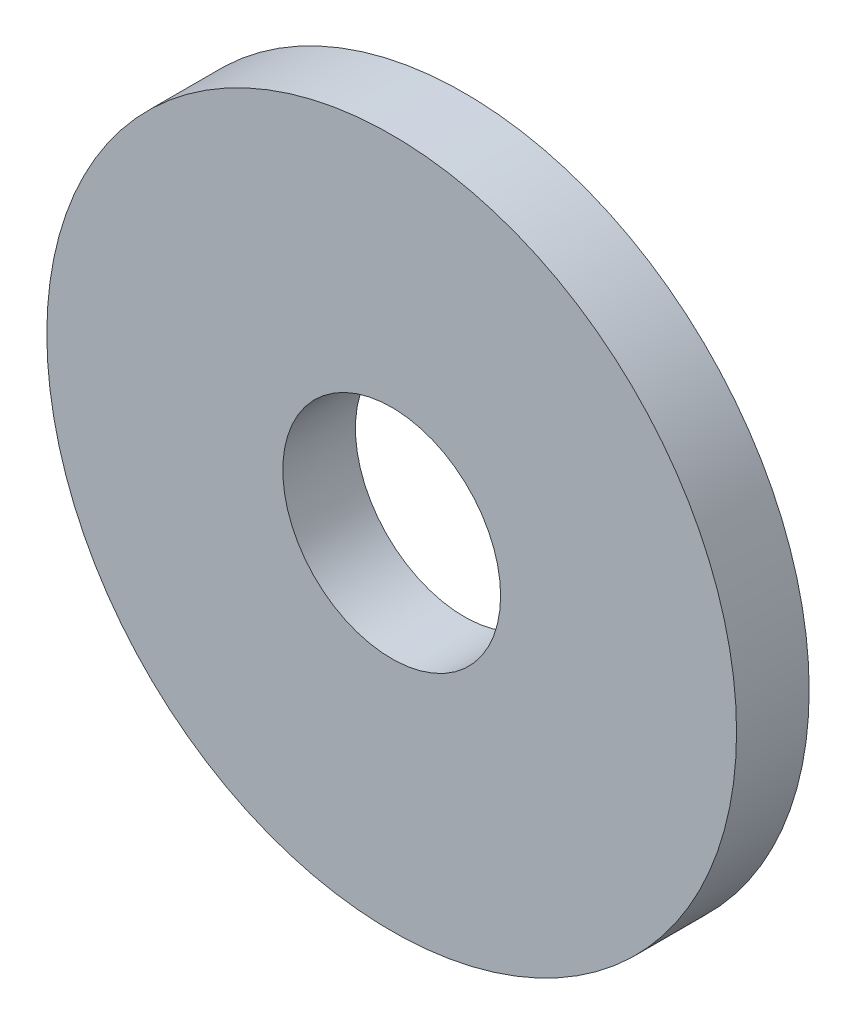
from build123d import *

# Parameters (mm, degrees)
ESQUISSE1_R      = 4.75
ESQUISSE1_R_2    = 1.5
EXTRUSION1_DEPTH = 1


with BuildPart() as part:
    # Esquisse1 → Extrusion1 (new body)
    with BuildSketch(Plane.XY):
        Circle(ESQUISSE1_R)
        Circle(ESQUISSE1_R_2, mode=Mode.SUBTRACT)
    extrude(amount=EXTRUSION1_DEPTH)


solid = part.part
